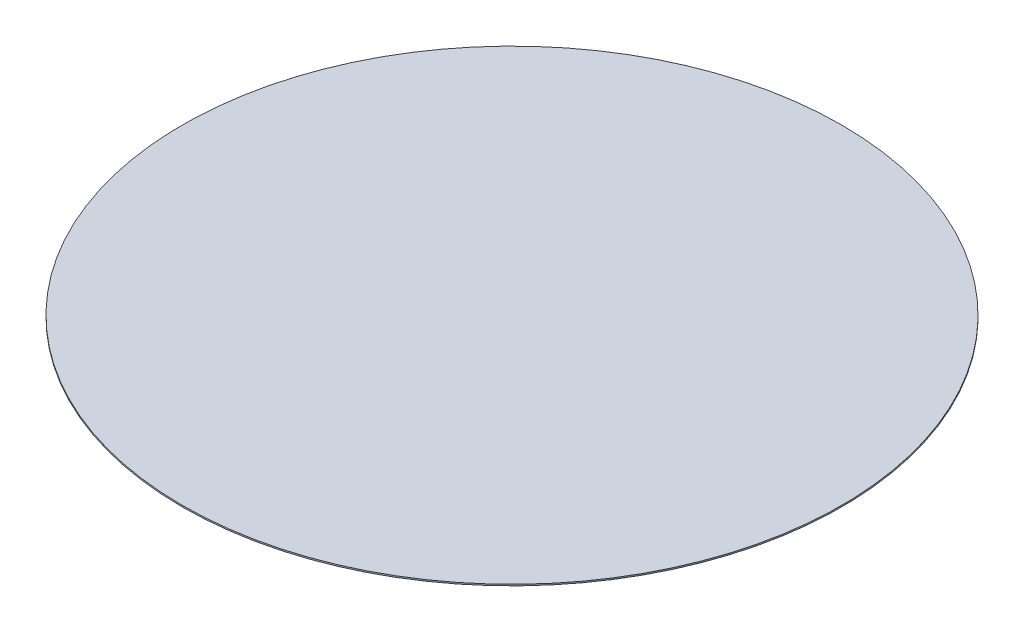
from build123d import *

# Parameters (mm, degrees)
SKETCH1_R           = 23.5
BOSS_EXTRUDE1_DEPTH = 0.1


with BuildPart() as part:
    # Sketch1 → Boss-Extrude1 (new body)
    with BuildSketch(Plane(origin=(0, 0, 0), x_dir=(1, 0, 0), z_dir=(0, 1, 0))):
        with Locations(Location((0, 0, 0), (0, 0, 270))):
            Circle(SKETCH1_R)
    extrude(amount=BOSS_EXTRUDE1_DEPTH)


solid = part.part
